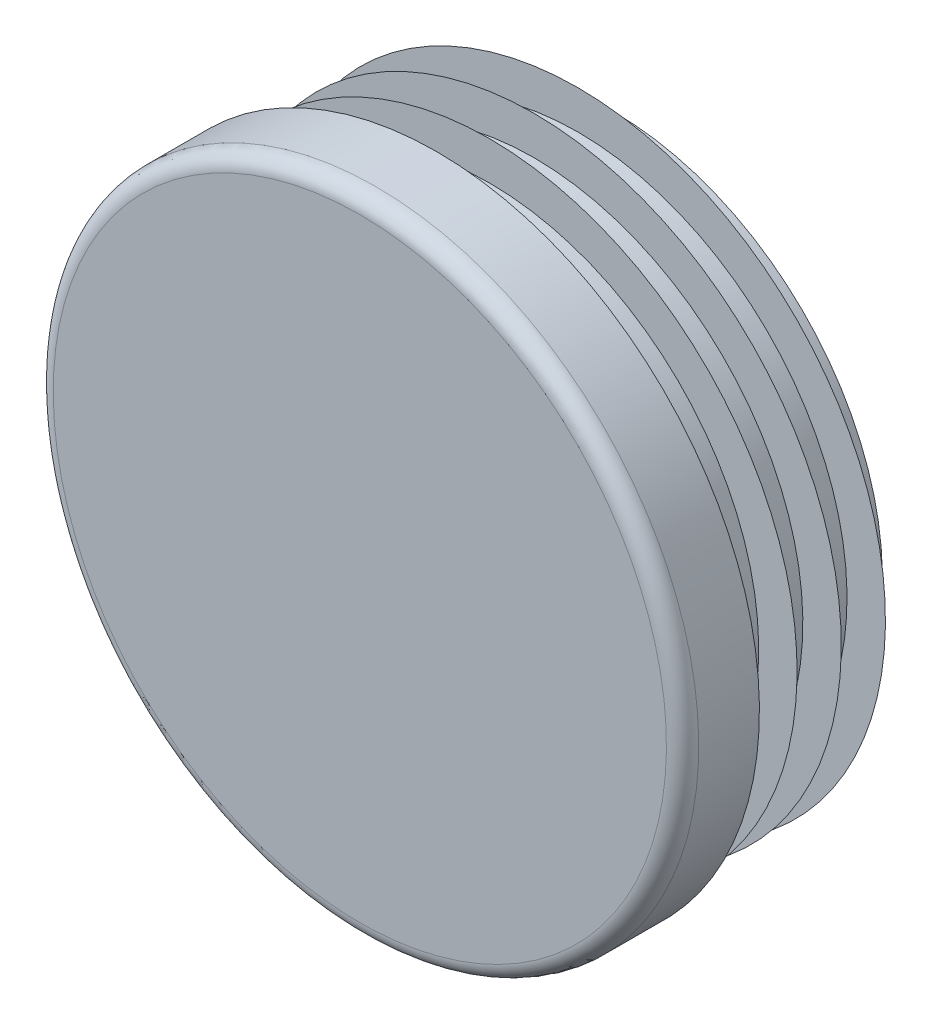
ISO-10303-21;
HEADER;
FILE_DESCRIPTION(('STEP AP214'),'2;1');
FILE_NAME('part.step','',(''),(''),'','','');
FILE_SCHEMA(('AUTOMOTIVE_DESIGN { 1 0 10303 214 1 1 1 1 }'));
ENDSEC;
DATA;
#1=APPLICATION_CONTEXT('core data for automotive mechanical design processes');
#2=APPLICATION_PROTOCOL_DEFINITION('international standard','automotive_design',2000,#1);
#3=PRODUCT_CONTEXT('',#1,'mechanical');
#4=PRODUCT('Part','Part','',(#3));
#5=PRODUCT_RELATED_PRODUCT_CATEGORY('part','',(#4));
#6=PRODUCT_DEFINITION_FORMATION('','',#4);
#7=PRODUCT_DEFINITION_CONTEXT('part definition',#1,'design');
#8=PRODUCT_DEFINITION('design','',#6,#7);
#9=PRODUCT_DEFINITION_SHAPE('','',#8);
#10=(LENGTH_UNIT() NAMED_UNIT(*) SI_UNIT(.MILLI.,.METRE.));
#11=(NAMED_UNIT(*) PLANE_ANGLE_UNIT() SI_UNIT($,.RADIAN.));
#12=(NAMED_UNIT(*) SI_UNIT($,.STERADIAN.) SOLID_ANGLE_UNIT());
#13=UNCERTAINTY_MEASURE_WITH_UNIT(LENGTH_MEASURE(1.E-05),#10,'distance_accuracy_value','');
#14=(GEOMETRIC_REPRESENTATION_CONTEXT(3) GLOBAL_UNCERTAINTY_ASSIGNED_CONTEXT((#13)) GLOBAL_UNIT_ASSIGNED_CONTEXT((#10,
#11,#12)) REPRESENTATION_CONTEXT('',''));
#15=CARTESIAN_POINT('',(0.,0.,0.));
#16=DIRECTION('',(0.,0.,1.));
#17=DIRECTION('',(1.,0.,0.));
#18=AXIS2_PLACEMENT_3D('',#15,#16,#17);
#19=CARTESIAN_POINT('',(0.,0.,5.));
#20=DIRECTION('',(0.,0.,-1.));
#21=DIRECTION('',(0.,1.,0.));
#22=AXIS2_PLACEMENT_3D('',#19,#20,#21);
#23=PLANE('',#22);
#24=CARTESIAN_POINT('',(0.,0.,5.));
#25=DIRECTION('',(0.,0.,-1.));
#26=DIRECTION('',(0.,1.,0.));
#27=AXIS2_PLACEMENT_3D('',#24,#25,#26);
#28=CIRCLE('',#27,19.95);
#29=CARTESIAN_POINT('',(0.,19.95,5.));
#30=VERTEX_POINT('',#29);
#31=EDGE_CURVE('E8',#30,#30,#28,.T.);
#32=ORIENTED_EDGE('',*,*,#31,.F.);
#33=EDGE_LOOP('',(#32));
#34=FACE_BOUND('',#33,.T.);
#35=ADVANCED_FACE('F12',(#34),#23,.F.);
#36=CARTESIAN_POINT('',(0.,0.,3.95));
#37=DIRECTION('',(0.,0.,-1.));
#38=DIRECTION('',(0.,1.,0.));
#39=AXIS2_PLACEMENT_3D('',#36,#37,#38);
#40=TOROIDAL_SURFACE('',#39,19.95,1.05);
#41=ORIENTED_EDGE('',*,*,#31,.T.);
#42=EDGE_LOOP('',(#41));
#43=FACE_BOUND('',#42,.T.);
#44=CARTESIAN_POINT('',(0.,0.,3.95));
#45=DIRECTION('',(0.,0.,-1.));
#46=DIRECTION('',(0.,1.,0.));
#47=AXIS2_PLACEMENT_3D('',#44,#45,#46);
#48=CIRCLE('',#47,21.);
#49=CARTESIAN_POINT('',(0.,21.,3.95));
#50=VERTEX_POINT('',#49);
#51=EDGE_CURVE('E18',#50,#50,#48,.T.);
#52=ORIENTED_EDGE('',*,*,#51,.F.);
#53=EDGE_LOOP('',(#52));
#54=FACE_BOUND('',#53,.T.);
#55=ADVANCED_FACE('F159',(#43,#54),#40,.T.);
#56=CARTESIAN_POINT('',(0.,0.,-11.5));
#57=DIRECTION('',(0.,0.,-1.));
#58=DIRECTION('',(0.,1.,0.));
#59=AXIS2_PLACEMENT_3D('',#56,#57,#58);
#60=CYLINDRICAL_SURFACE('',#59,21.);
#61=CARTESIAN_POINT('',(0.,0.,0.));
#62=DIRECTION('',(0.,0.,-1.));
#63=DIRECTION('',(0.,1.,0.));
#64=AXIS2_PLACEMENT_3D('',#61,#62,#63);
#65=CIRCLE('',#64,21.);
#66=CARTESIAN_POINT('',(0.,21.,0.));
#67=VERTEX_POINT('',#66);
#68=EDGE_CURVE('E22',#67,#67,#65,.T.);
#69=ORIENTED_EDGE('',*,*,#68,.F.);
#70=EDGE_LOOP('',(#69));
#71=FACE_BOUND('',#70,.T.);
#72=ORIENTED_EDGE('',*,*,#51,.T.);
#73=EDGE_LOOP('',(#72));
#74=FACE_BOUND('',#73,.T.);
#75=ADVANCED_FACE('F154',(#71,#74),#60,.T.);
#76=CARTESIAN_POINT('',(21.,0.,0.));
#77=DIRECTION('',(0.,0.,1.));
#78=DIRECTION('',(0.,-1.,0.));
#79=AXIS2_PLACEMENT_3D('',#76,#77,#78);
#80=PLANE('',#79);
#81=CARTESIAN_POINT('',(0.,0.,0.));
#82=DIRECTION('',(0.,0.,-1.));
#83=DIRECTION('',(0.,1.,0.));
#84=AXIS2_PLACEMENT_3D('',#81,#82,#83);
#85=CIRCLE('',#84,17.5);
#86=CARTESIAN_POINT('',(0.,17.5,0.));
#87=VERTEX_POINT('',#86);
#88=EDGE_CURVE('E26',#87,#87,#85,.T.);
#89=ORIENTED_EDGE('',*,*,#88,.F.);
#90=EDGE_LOOP('',(#89));
#91=FACE_BOUND('',#90,.T.);
#92=ORIENTED_EDGE('',*,*,#68,.T.);
#93=EDGE_LOOP('',(#92));
#94=FACE_BOUND('',#93,.T.);
#95=ADVANCED_FACE('F148',(#91,#94),#80,.F.);
#96=CARTESIAN_POINT('',(0.,0.,-11.5));
#97=DIRECTION('',(0.,0.,-1.));
#98=DIRECTION('',(0.,1.,0.));
#99=AXIS2_PLACEMENT_3D('',#96,#97,#98);
#100=CYLINDRICAL_SURFACE('',#99,17.5);
#101=CARTESIAN_POINT('',(0.,0.,-0.575));
#102=DIRECTION('',(0.,0.,-1.));
#103=DIRECTION('',(0.,1.,0.));
#104=AXIS2_PLACEMENT_3D('',#101,#102,#103);
#105=CIRCLE('',#104,17.5);
#106=CARTESIAN_POINT('',(0.,17.5,-0.575));
#107=VERTEX_POINT('',#106);
#108=EDGE_CURVE('E31',#107,#107,#105,.T.);
#109=ORIENTED_EDGE('',*,*,#108,.F.);
#110=EDGE_LOOP('',(#109));
#111=FACE_BOUND('',#110,.T.);
#112=ORIENTED_EDGE('',*,*,#88,.T.);
#113=EDGE_LOOP('',(#112));
#114=FACE_BOUND('',#113,.T.);
#115=ADVANCED_FACE('F142',(#111,#114),#100,.T.);
#116=CARTESIAN_POINT('',(17.5,0.,-0.575));
#117=DIRECTION('',(0.,0.,-1.));
#118=DIRECTION('',(0.,1.,0.));
#119=AXIS2_PLACEMENT_3D('',#116,#117,#118);
#120=PLANE('',#119);
#121=CARTESIAN_POINT('',(0.,0.,-0.575));
#122=DIRECTION('',(0.,0.,-1.));
#123=DIRECTION('',(0.,1.,0.));
#124=AXIS2_PLACEMENT_3D('',#121,#122,#123);
#125=CIRCLE('',#124,20.);
#126=CARTESIAN_POINT('',(0.,20.,-0.575));
#127=VERTEX_POINT('',#126);
#128=EDGE_CURVE('E34',#127,#127,#125,.T.);
#129=ORIENTED_EDGE('',*,*,#128,.F.);
#130=EDGE_LOOP('',(#129));
#131=FACE_BOUND('',#130,.T.);
#132=ORIENTED_EDGE('',*,*,#108,.T.);
#133=EDGE_LOOP('',(#132));
#134=FACE_BOUND('',#133,.T.);
#135=ADVANCED_FACE('F136',(#131,#134),#120,.F.);
#136=CARTESIAN_POINT('',(0.,0.,-0.575));
#137=DIRECTION('',(0.,0.,1.));
#138=DIRECTION('',(0.,-1.,0.));
#139=AXIS2_PLACEMENT_3D('',#136,#137,#138);
#140=CONICAL_SURFACE('',#139,20.,0.959931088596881);
#141=CARTESIAN_POINT('',(0.,0.,-2.32551884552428));
#142=DIRECTION('',(0.,0.,-1.));
#143=DIRECTION('',(0.,1.,0.));
#144=AXIS2_PLACEMENT_3D('',#141,#142,#143);
#145=CIRCLE('',#144,17.5);
#146=CARTESIAN_POINT('',(0.,17.5,-2.32551884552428));
#147=VERTEX_POINT('',#146);
#148=EDGE_CURVE('E37',#147,#147,#145,.T.);
#149=ORIENTED_EDGE('',*,*,#148,.F.);
#150=EDGE_LOOP('',(#149));
#151=FACE_BOUND('',#150,.T.);
#152=ORIENTED_EDGE('',*,*,#128,.T.);
#153=EDGE_LOOP('',(#152));
#154=FACE_BOUND('',#153,.T.);
#155=ADVANCED_FACE('F130',(#151,#154),#140,.T.);
#156=CARTESIAN_POINT('',(0.,0.,-11.5));
#157=DIRECTION('',(0.,0.,-1.));
#158=DIRECTION('',(0.,1.,0.));
#159=AXIS2_PLACEMENT_3D('',#156,#157,#158);
#160=CYLINDRICAL_SURFACE('',#159,17.5);
#161=CARTESIAN_POINT('',(0.,0.,-3.45));
#162=DIRECTION('',(0.,0.,-1.));
#163=DIRECTION('',(0.,1.,0.));
#164=AXIS2_PLACEMENT_3D('',#161,#162,#163);
#165=CIRCLE('',#164,17.5);
#166=CARTESIAN_POINT('',(0.,17.5,-3.45));
#167=VERTEX_POINT('',#166);
#168=EDGE_CURVE('E40',#167,#167,#165,.T.);
#169=ORIENTED_EDGE('',*,*,#168,.F.);
#170=EDGE_LOOP('',(#169));
#171=FACE_BOUND('',#170,.T.);
#172=ORIENTED_EDGE('',*,*,#148,.T.);
#173=EDGE_LOOP('',(#172));
#174=FACE_BOUND('',#173,.T.);
#175=ADVANCED_FACE('F124',(#171,#174),#160,.T.);
#176=CARTESIAN_POINT('',(17.5,0.,-3.45));
#177=DIRECTION('',(0.,0.,-1.));
#178=DIRECTION('',(0.,1.,0.));
#179=AXIS2_PLACEMENT_3D('',#176,#177,#178);
#180=PLANE('',#179);
#181=CARTESIAN_POINT('',(0.,0.,-3.45));
#182=DIRECTION('',(0.,0.,-1.));
#183=DIRECTION('',(0.,1.,0.));
#184=AXIS2_PLACEMENT_3D('',#181,#182,#183);
#185=CIRCLE('',#184,20.);
#186=CARTESIAN_POINT('',(0.,20.,-3.45));
#187=VERTEX_POINT('',#186);
#188=EDGE_CURVE('E43',#187,#187,#185,.T.);
#189=ORIENTED_EDGE('',*,*,#188,.F.);
#190=EDGE_LOOP('',(#189));
#191=FACE_BOUND('',#190,.T.);
#192=ORIENTED_EDGE('',*,*,#168,.T.);
#193=EDGE_LOOP('',(#192));
#194=FACE_BOUND('',#193,.T.);
#195=ADVANCED_FACE('F118',(#191,#194),#180,.F.);
#196=CARTESIAN_POINT('',(0.,0.,-3.45));
#197=DIRECTION('',(0.,0.,1.));
#198=DIRECTION('',(0.,-1.,0.));
#199=AXIS2_PLACEMENT_3D('',#196,#197,#198);
#200=CONICAL_SURFACE('',#199,20.,0.959931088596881);
#201=CARTESIAN_POINT('',(0.,0.,-5.20051884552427));
#202=DIRECTION('',(0.,0.,-1.));
#203=DIRECTION('',(0.,1.,0.));
#204=AXIS2_PLACEMENT_3D('',#201,#202,#203);
#205=CIRCLE('',#204,17.5);
#206=CARTESIAN_POINT('',(0.,17.5,-5.20051884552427));
#207=VERTEX_POINT('',#206);
#208=EDGE_CURVE('E46',#207,#207,#205,.T.);
#209=ORIENTED_EDGE('',*,*,#208,.F.);
#210=EDGE_LOOP('',(#209));
#211=FACE_BOUND('',#210,.T.);
#212=ORIENTED_EDGE('',*,*,#188,.T.);
#213=EDGE_LOOP('',(#212));
#214=FACE_BOUND('',#213,.T.);
#215=ADVANCED_FACE('F112',(#211,#214),#200,.T.);
#216=CARTESIAN_POINT('',(0.,0.,-11.5));
#217=DIRECTION('',(0.,0.,-1.));
#218=DIRECTION('',(0.,1.,0.));
#219=AXIS2_PLACEMENT_3D('',#216,#217,#218);
#220=CYLINDRICAL_SURFACE('',#219,17.5);
#221=CARTESIAN_POINT('',(0.,0.,-6.325));
#222=DIRECTION('',(0.,0.,-1.));
#223=DIRECTION('',(0.,1.,0.));
#224=AXIS2_PLACEMENT_3D('',#221,#222,#223);
#225=CIRCLE('',#224,17.5);
#226=CARTESIAN_POINT('',(0.,17.5,-6.325));
#227=VERTEX_POINT('',#226);
#228=EDGE_CURVE('E49',#227,#227,#225,.T.);
#229=ORIENTED_EDGE('',*,*,#228,.F.);
#230=EDGE_LOOP('',(#229));
#231=FACE_BOUND('',#230,.T.);
#232=ORIENTED_EDGE('',*,*,#208,.T.);
#233=EDGE_LOOP('',(#232));
#234=FACE_BOUND('',#233,.T.);
#235=ADVANCED_FACE('F106',(#231,#234),#220,.T.);
#236=CARTESIAN_POINT('',(17.5,0.,-6.325));
#237=DIRECTION('',(0.,0.,-1.));
#238=DIRECTION('',(0.,1.,0.));
#239=AXIS2_PLACEMENT_3D('',#236,#237,#238);
#240=PLANE('',#239);
#241=CARTESIAN_POINT('',(0.,0.,-6.325));
#242=DIRECTION('',(0.,0.,-1.));
#243=DIRECTION('',(0.,1.,0.));
#244=AXIS2_PLACEMENT_3D('',#241,#242,#243);
#245=CIRCLE('',#244,20.);
#246=CARTESIAN_POINT('',(0.,20.,-6.325));
#247=VERTEX_POINT('',#246);
#248=EDGE_CURVE('E52',#247,#247,#245,.T.);
#249=ORIENTED_EDGE('',*,*,#248,.F.);
#250=EDGE_LOOP('',(#249));
#251=FACE_BOUND('',#250,.T.);
#252=ORIENTED_EDGE('',*,*,#228,.T.);
#253=EDGE_LOOP('',(#252));
#254=FACE_BOUND('',#253,.T.);
#255=ADVANCED_FACE('F100',(#251,#254),#240,.F.);
#256=CARTESIAN_POINT('',(0.,0.,-6.325));
#257=DIRECTION('',(0.,0.,1.));
#258=DIRECTION('',(0.,-1.,0.));
#259=AXIS2_PLACEMENT_3D('',#256,#257,#258);
#260=CONICAL_SURFACE('',#259,20.,0.95993108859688);
#261=CARTESIAN_POINT('',(0.,0.,-8.07551884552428));
#262=DIRECTION('',(0.,0.,-1.));
#263=DIRECTION('',(0.,1.,0.));
#264=AXIS2_PLACEMENT_3D('',#261,#262,#263);
#265=CIRCLE('',#264,17.5);
#266=CARTESIAN_POINT('',(0.,17.5,-8.07551884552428));
#267=VERTEX_POINT('',#266);
#268=EDGE_CURVE('E55',#267,#267,#265,.T.);
#269=ORIENTED_EDGE('',*,*,#268,.F.);
#270=EDGE_LOOP('',(#269));
#271=FACE_BOUND('',#270,.T.);
#272=ORIENTED_EDGE('',*,*,#248,.T.);
#273=EDGE_LOOP('',(#272));
#274=FACE_BOUND('',#273,.T.);
#275=ADVANCED_FACE('F94',(#271,#274),#260,.T.);
#276=CARTESIAN_POINT('',(0.,0.,-11.5));
#277=DIRECTION('',(0.,0.,-1.));
#278=DIRECTION('',(0.,1.,0.));
#279=AXIS2_PLACEMENT_3D('',#276,#277,#278);
#280=CYLINDRICAL_SURFACE('',#279,17.5);
#281=CARTESIAN_POINT('',(0.,0.,-9.2));
#282=DIRECTION('',(0.,0.,-1.));
#283=DIRECTION('',(0.,1.,0.));
#284=AXIS2_PLACEMENT_3D('',#281,#282,#283);
#285=CIRCLE('',#284,17.5);
#286=CARTESIAN_POINT('',(0.,17.5,-9.2));
#287=VERTEX_POINT('',#286);
#288=EDGE_CURVE('E58',#287,#287,#285,.T.);
#289=ORIENTED_EDGE('',*,*,#288,.F.);
#290=EDGE_LOOP('',(#289));
#291=FACE_BOUND('',#290,.T.);
#292=ORIENTED_EDGE('',*,*,#268,.T.);
#293=EDGE_LOOP('',(#292));
#294=FACE_BOUND('',#293,.T.);
#295=ADVANCED_FACE('F88',(#291,#294),#280,.T.);
#296=CARTESIAN_POINT('',(17.5,0.,-9.2));
#297=DIRECTION('',(0.,0.,-1.));
#298=DIRECTION('',(0.,1.,0.));
#299=AXIS2_PLACEMENT_3D('',#296,#297,#298);
#300=PLANE('',#299);
#301=CARTESIAN_POINT('',(0.,0.,-9.2));
#302=DIRECTION('',(0.,0.,-1.));
#303=DIRECTION('',(0.,1.,0.));
#304=AXIS2_PLACEMENT_3D('',#301,#302,#303);
#305=CIRCLE('',#304,20.);
#306=CARTESIAN_POINT('',(0.,20.,-9.2));
#307=VERTEX_POINT('',#306);
#308=EDGE_CURVE('E61',#307,#307,#305,.T.);
#309=ORIENTED_EDGE('',*,*,#308,.F.);
#310=EDGE_LOOP('',(#309));
#311=FACE_BOUND('',#310,.T.);
#312=ORIENTED_EDGE('',*,*,#288,.T.);
#313=EDGE_LOOP('',(#312));
#314=FACE_BOUND('',#313,.T.);
#315=ADVANCED_FACE('F82',(#311,#314),#300,.F.);
#316=CARTESIAN_POINT('',(0.,0.,-9.2));
#317=DIRECTION('',(0.,0.,1.));
#318=DIRECTION('',(0.,-1.,0.));
#319=AXIS2_PLACEMENT_3D('',#316,#317,#318);
#320=CONICAL_SURFACE('',#319,20.,0.959931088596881);
#321=CARTESIAN_POINT('',(0.,0.,-10.9505188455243));
#322=DIRECTION('',(0.,0.,-1.));
#323=DIRECTION('',(0.,1.,0.));
#324=AXIS2_PLACEMENT_3D('',#321,#322,#323);
#325=CIRCLE('',#324,17.5);
#326=CARTESIAN_POINT('',(0.,17.5,-10.9505188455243));
#327=VERTEX_POINT('',#326);
#328=EDGE_CURVE('E64',#327,#327,#325,.T.);
#329=ORIENTED_EDGE('',*,*,#328,.F.);
#330=EDGE_LOOP('',(#329));
#331=FACE_BOUND('',#330,.T.);
#332=ORIENTED_EDGE('',*,*,#308,.T.);
#333=EDGE_LOOP('',(#332));
#334=FACE_BOUND('',#333,.T.);
#335=ADVANCED_FACE('F76',(#331,#334),#320,.T.);
#336=CARTESIAN_POINT('',(0.,0.,-11.5));
#337=DIRECTION('',(0.,0.,-1.));
#338=DIRECTION('',(0.,1.,0.));
#339=AXIS2_PLACEMENT_3D('',#336,#337,#338);
#340=CYLINDRICAL_SURFACE('',#339,17.5);
#341=CARTESIAN_POINT('',(0.,0.,-11.5));
#342=DIRECTION('',(0.,0.,-1.));
#343=DIRECTION('',(0.,1.,0.));
#344=AXIS2_PLACEMENT_3D('',#341,#342,#343);
#345=CIRCLE('',#344,17.5);
#346=CARTESIAN_POINT('',(0.,17.5,-11.5));
#347=VERTEX_POINT('',#346);
#348=EDGE_CURVE('E67',#347,#347,#345,.T.);
#349=ORIENTED_EDGE('',*,*,#348,.F.);
#350=EDGE_LOOP('',(#349));
#351=FACE_BOUND('',#350,.T.);
#352=ORIENTED_EDGE('',*,*,#328,.T.);
#353=EDGE_LOOP('',(#352));
#354=FACE_BOUND('',#353,.T.);
#355=ADVANCED_FACE('F73',(#351,#354),#340,.T.);
#356=CARTESIAN_POINT('',(17.5,0.,-11.5));
#357=DIRECTION('',(0.,0.,1.));
#358=DIRECTION('',(0.,-1.,0.));
#359=AXIS2_PLACEMENT_3D('',#356,#357,#358);
#360=PLANE('',#359);
#361=ORIENTED_EDGE('',*,*,#348,.T.);
#362=EDGE_LOOP('',(#361));
#363=FACE_BOUND('',#362,.T.);
#364=ADVANCED_FACE('F71',(#363),#360,.F.);
#365=CLOSED_SHELL('',(#35,#55,#75,#95,#115,#135,#155,#175,#195,#215,#235,#255,#275,#295,#315,
#335,#355,#364));
#366=MANIFOLD_SOLID_BREP('B1',#365);
#367=ADVANCED_BREP_SHAPE_REPRESENTATION('',(#18,#366),#14);
#368=SHAPE_DEFINITION_REPRESENTATION(#9,#367);
ENDSEC;
END-ISO-10303-21;
